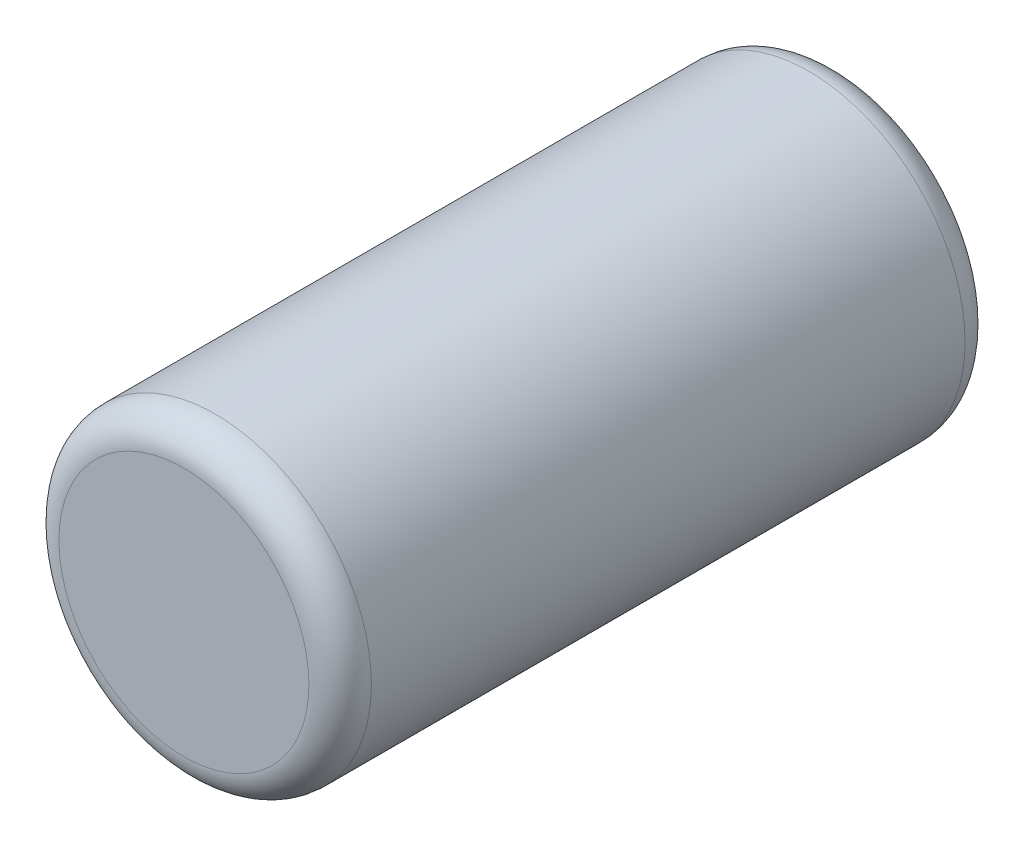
ISO-10303-21;
HEADER;
FILE_DESCRIPTION(('STEP AP214'),'2;1');
FILE_NAME('part.step','',(''),(''),'','','');
FILE_SCHEMA(('AUTOMOTIVE_DESIGN { 1 0 10303 214 1 1 1 1 }'));
ENDSEC;
DATA;
#1=APPLICATION_CONTEXT('core data for automotive mechanical design processes');
#2=APPLICATION_PROTOCOL_DEFINITION('international standard','automotive_design',2000,#1);
#3=PRODUCT_CONTEXT('',#1,'mechanical');
#4=PRODUCT('Part','Part','',(#3));
#5=PRODUCT_RELATED_PRODUCT_CATEGORY('part','',(#4));
#6=PRODUCT_DEFINITION_FORMATION('','',#4);
#7=PRODUCT_DEFINITION_CONTEXT('part definition',#1,'design');
#8=PRODUCT_DEFINITION('design','',#6,#7);
#9=PRODUCT_DEFINITION_SHAPE('','',#8);
#10=(LENGTH_UNIT() NAMED_UNIT(*) SI_UNIT(.MILLI.,.METRE.));
#11=(NAMED_UNIT(*) PLANE_ANGLE_UNIT() SI_UNIT($,.RADIAN.));
#12=(NAMED_UNIT(*) SI_UNIT($,.STERADIAN.) SOLID_ANGLE_UNIT());
#13=UNCERTAINTY_MEASURE_WITH_UNIT(LENGTH_MEASURE(1.E-05),#10,'distance_accuracy_value','');
#14=(GEOMETRIC_REPRESENTATION_CONTEXT(3) GLOBAL_UNCERTAINTY_ASSIGNED_CONTEXT((#13)) GLOBAL_UNIT_ASSIGNED_CONTEXT((#10,
#11,#12)) REPRESENTATION_CONTEXT('',''));
#15=CARTESIAN_POINT('',(0.,0.,0.));
#16=DIRECTION('',(0.,0.,1.));
#17=DIRECTION('',(1.,0.,0.));
#18=AXIS2_PLACEMENT_3D('',#15,#16,#17);
#19=CARTESIAN_POINT('',(0.,0.,10.5));
#20=DIRECTION('',(0.,0.,-1.));
#21=DIRECTION('',(-1.,0.,0.));
#22=AXIS2_PLACEMENT_3D('',#19,#20,#21);
#23=CYLINDRICAL_SURFACE('',#22,5.);
#24=CARTESIAN_POINT('',(0.,0.,9.5));
#25=DIRECTION('',(0.,0.,1.));
#26=DIRECTION('',(1.,0.,0.));
#27=AXIS2_PLACEMENT_3D('',#24,#25,#26);
#28=CIRCLE('',#27,5.);
#29=CARTESIAN_POINT('',(-5.,0.,9.5));
#30=VERTEX_POINT('',#29);
#31=EDGE_CURVE('E40',#30,#30,#28,.F.);
#32=CARTESIAN_POINT('',(0.,0.,-9.5));
#33=DIRECTION('',(0.,0.,1.));
#34=DIRECTION('',(1.,0.,0.));
#35=AXIS2_PLACEMENT_3D('',#32,#33,#34);
#36=CIRCLE('',#35,5.);
#37=CARTESIAN_POINT('',(-5.,0.,-9.50000000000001));
#38=VERTEX_POINT('',#37);
#39=EDGE_CURVE('E44',#38,#38,#36,.T.);
#40=CARTESIAN_POINT('',(-5.,0.,9.5));
#41=CARTESIAN_POINT('',(-5.,0.,9.30208333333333));
#42=CARTESIAN_POINT('',(-5.,0.,9.10416666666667));
#43=CARTESIAN_POINT('',(-5.,0.,8.70833333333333));
#44=CARTESIAN_POINT('',(-5.,0.,8.51041666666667));
#45=CARTESIAN_POINT('',(-5.,0.,8.11458333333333));
#46=CARTESIAN_POINT('',(-5.,0.,7.91666666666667));
#47=CARTESIAN_POINT('',(-5.,0.,7.52083333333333));
#48=CARTESIAN_POINT('',(-5.,0.,7.32291666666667));
#49=CARTESIAN_POINT('',(-5.,0.,6.92708333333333));
#50=CARTESIAN_POINT('',(-5.,0.,6.72916666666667));
#51=CARTESIAN_POINT('',(-5.,0.,6.33333333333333));
#52=CARTESIAN_POINT('',(-5.,0.,6.13541666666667));
#53=CARTESIAN_POINT('',(-5.,0.,5.73958333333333));
#54=CARTESIAN_POINT('',(-5.,0.,5.54166666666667));
#55=CARTESIAN_POINT('',(-5.,0.,5.14583333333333));
#56=CARTESIAN_POINT('',(-5.,0.,4.94791666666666));
#57=CARTESIAN_POINT('',(-5.,0.,4.55208333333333));
#58=CARTESIAN_POINT('',(-5.,0.,4.35416666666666));
#59=CARTESIAN_POINT('',(-5.,0.,3.95833333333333));
#60=CARTESIAN_POINT('',(-5.,0.,3.76041666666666));
#61=CARTESIAN_POINT('',(-5.,0.,3.36458333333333));
#62=CARTESIAN_POINT('',(-5.,0.,3.16666666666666));
#63=CARTESIAN_POINT('',(-5.,0.,2.77083333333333));
#64=CARTESIAN_POINT('',(-5.,0.,2.57291666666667));
#65=CARTESIAN_POINT('',(-5.,0.,2.17708333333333));
#66=CARTESIAN_POINT('',(-5.,0.,1.97916666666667));
#67=CARTESIAN_POINT('',(-5.,0.,1.58333333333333));
#68=CARTESIAN_POINT('',(-5.,0.,1.38541666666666));
#69=CARTESIAN_POINT('',(-5.,0.,0.989583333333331));
#70=CARTESIAN_POINT('',(-5.,0.,0.791666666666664));
#71=CARTESIAN_POINT('',(-5.,0.,0.39583333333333));
#72=CARTESIAN_POINT('',(-5.,0.,0.197916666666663));
#73=CARTESIAN_POINT('',(-5.,0.,-0.19791666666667));
#74=CARTESIAN_POINT('',(-5.,0.,-0.395833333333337));
#75=CARTESIAN_POINT('',(-5.,0.,-0.791666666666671));
#76=CARTESIAN_POINT('',(-5.,0.,-0.989583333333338));
#77=CARTESIAN_POINT('',(-5.,0.,-1.38541666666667));
#78=CARTESIAN_POINT('',(-5.,0.,-1.58333333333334));
#79=CARTESIAN_POINT('',(-5.,0.,-1.97916666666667));
#80=CARTESIAN_POINT('',(-5.,0.,-2.17708333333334));
#81=CARTESIAN_POINT('',(-5.,0.,-2.57291666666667));
#82=CARTESIAN_POINT('',(-5.,0.,-2.77083333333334));
#83=CARTESIAN_POINT('',(-5.,0.,-3.16666666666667));
#84=CARTESIAN_POINT('',(-5.,0.,-3.36458333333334));
#85=CARTESIAN_POINT('',(-5.,0.,-3.76041666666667));
#86=CARTESIAN_POINT('',(-5.,0.,-3.95833333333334));
#87=CARTESIAN_POINT('',(-5.,0.,-4.35416666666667));
#88=CARTESIAN_POINT('',(-5.,0.,-4.55208333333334));
#89=CARTESIAN_POINT('',(-5.,0.,-4.94791666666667));
#90=CARTESIAN_POINT('',(-5.,0.,-5.14583333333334));
#91=CARTESIAN_POINT('',(-5.,0.,-5.54166666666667));
#92=CARTESIAN_POINT('',(-5.,0.,-5.73958333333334));
#93=CARTESIAN_POINT('',(-5.,0.,-6.13541666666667));
#94=CARTESIAN_POINT('',(-5.,0.,-6.33333333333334));
#95=CARTESIAN_POINT('',(-5.,0.,-6.72916666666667));
#96=CARTESIAN_POINT('',(-5.,0.,-6.92708333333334));
#97=CARTESIAN_POINT('',(-5.,0.,-7.32291666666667));
#98=CARTESIAN_POINT('',(-5.,0.,-7.52083333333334));
#99=CARTESIAN_POINT('',(-5.,0.,-7.91666666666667));
#100=CARTESIAN_POINT('',(-5.,0.,-8.11458333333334));
#101=CARTESIAN_POINT('',(-5.,0.,-8.51041666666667));
#102=CARTESIAN_POINT('',(-5.,0.,-8.70833333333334));
#103=CARTESIAN_POINT('',(-5.,0.,-9.10416666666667));
#104=CARTESIAN_POINT('',(-5.,0.,-9.30208333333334));
#105=CARTESIAN_POINT('',(-5.,0.,-9.50000000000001));
#106=B_SPLINE_CURVE_WITH_KNOTS('',3,(#40,#41,#42,#43,#44,#45,#46,#47,#48,#49,#50,#51,#52,#53,
#54,#55,#56,#57,#58,#59,#60,#61,#62,#63,#64,#65,#66,#67,#68,#69,#70,#71,#72,#73,#74,#75,#76,#77,
#78,#79,#80,#81,#82,#83,#84,#85,#86,#87,#88,#89,#90,#91,#92,#93,#94,#95,#96,#97,#98,#99,#100,
#101,#102,#103,#104,#105),.UNSPECIFIED.,.F.,.F.,(4,2,2,2,2,2,2,2,2,2,2,2,2,2,2,2,2,2,2,2,2,2,2,
2,2,2,2,2,2,2,2,2,4),(0.,0.593749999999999,1.1875,1.78125,2.375,2.96875,3.5625,4.15625,4.75,
5.34375,5.9375,6.53125,7.125,7.71875,8.3125,8.90625,9.5,10.09375,10.6875,11.28125,11.875,
12.46875,13.0625,13.65625,14.25,14.84375,15.4375,16.03125,16.625,17.21875,17.8125,18.40625,19.),.UNSPECIFIED.);
#107=EDGE_CURVE('BSEAM34',#30,#38,#106,.T.);
#108=ORIENTED_EDGE('',*,*,#31,.T.);
#109=ORIENTED_EDGE('',*,*,#39,.T.);
#110=ORIENTED_EDGE('',*,*,#107,.T.);
#111=ORIENTED_EDGE('',*,*,#107,.F.);
#112=EDGE_LOOP('',(#108,#110,#109,#111));
#113=FACE_BOUND('',#112,.T.);
#114=ADVANCED_FACE('F34',(#113),#23,.T.);
#115=CARTESIAN_POINT('',(0.,0.,10.5));
#116=DIRECTION('',(0.,0.,1.));
#117=DIRECTION('',(1.,0.,0.));
#118=AXIS2_PLACEMENT_3D('',#115,#116,#117);
#119=PLANE('',#118);
#120=CARTESIAN_POINT('',(0.,0.,10.5));
#121=DIRECTION('',(0.,0.,1.));
#122=DIRECTION('',(1.,0.,0.));
#123=AXIS2_PLACEMENT_3D('',#120,#121,#122);
#124=CIRCLE('',#123,4.);
#125=CARTESIAN_POINT('',(4.,0.,10.5));
#126=VERTEX_POINT('',#125);
#127=EDGE_CURVE('E48',#126,#126,#124,.T.);
#128=ORIENTED_EDGE('',*,*,#127,.T.);
#129=EDGE_LOOP('',(#128));
#130=FACE_BOUND('',#129,.T.);
#131=ADVANCED_FACE('F54',(#130),#119,.T.);
#132=CARTESIAN_POINT('',(0.,0.,-10.5));
#133=DIRECTION('',(0.,0.,1.));
#134=DIRECTION('',(1.,0.,0.));
#135=AXIS2_PLACEMENT_3D('',#132,#133,#134);
#136=PLANE('',#135);
#137=CARTESIAN_POINT('',(0.,0.,-10.5));
#138=DIRECTION('',(0.,0.,1.));
#139=DIRECTION('',(1.,0.,0.));
#140=AXIS2_PLACEMENT_3D('',#137,#138,#139);
#141=CIRCLE('',#140,4.);
#142=CARTESIAN_POINT('',(4.,0.,-10.5));
#143=VERTEX_POINT('',#142);
#144=EDGE_CURVE('E10',#143,#143,#141,.F.);
#145=ORIENTED_EDGE('',*,*,#144,.T.);
#146=EDGE_LOOP('',(#145));
#147=FACE_BOUND('',#146,.T.);
#148=ADVANCED_FACE('F59',(#147),#136,.F.);
#149=CARTESIAN_POINT('',(0.,0.,9.5));
#150=DIRECTION('',(0.,0.,1.));
#151=DIRECTION('',(1.,0.,0.));
#152=AXIS2_PLACEMENT_3D('',#149,#150,#151);
#153=TOROIDAL_SURFACE('',#152,4.,1.);
#154=ORIENTED_EDGE('',*,*,#31,.F.);
#155=EDGE_LOOP('',(#154));
#156=FACE_BOUND('',#155,.T.);
#157=ORIENTED_EDGE('',*,*,#127,.F.);
#158=EDGE_LOOP('',(#157));
#159=FACE_BOUND('',#158,.T.);
#160=ADVANCED_FACE('F56',(#156,#159),#153,.T.);
#161=CARTESIAN_POINT('',(0.,0.,-9.5));
#162=DIRECTION('',(0.,0.,1.));
#163=DIRECTION('',(1.,0.,0.));
#164=AXIS2_PLACEMENT_3D('',#161,#162,#163);
#165=TOROIDAL_SURFACE('',#164,4.,1.);
#166=ORIENTED_EDGE('',*,*,#144,.F.);
#167=EDGE_LOOP('',(#166));
#168=FACE_BOUND('',#167,.T.);
#169=ORIENTED_EDGE('',*,*,#39,.F.);
#170=EDGE_LOOP('',(#169));
#171=FACE_BOUND('',#170,.T.);
#172=ADVANCED_FACE('F58',(#168,#171),#165,.T.);
#173=CLOSED_SHELL('',(#114,#131,#148,#160,#172));
#174=MANIFOLD_SOLID_BREP('B2',#173);
#175=ADVANCED_BREP_SHAPE_REPRESENTATION('',(#18,#174),#14);
#176=SHAPE_DEFINITION_REPRESENTATION(#9,#175);
ENDSEC;
END-ISO-10303-21;
